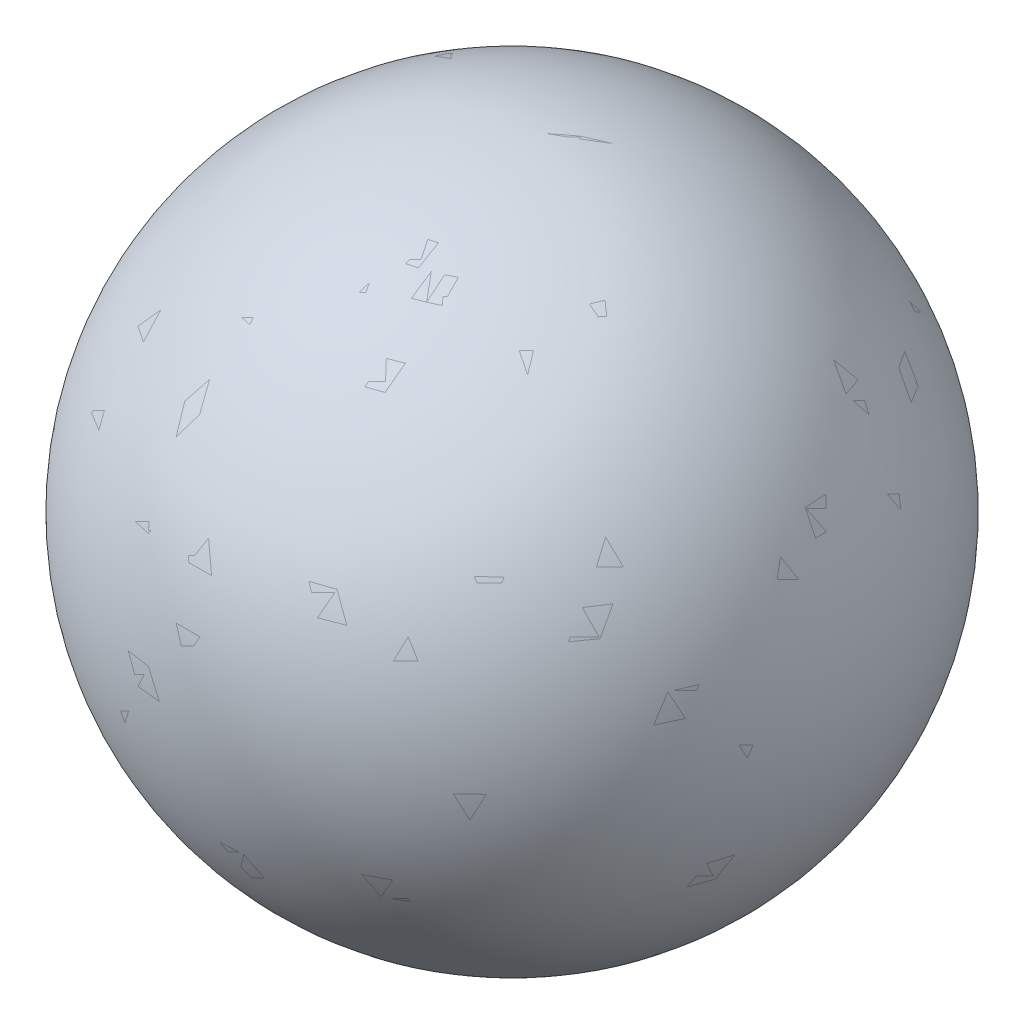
ISO-10303-21;
HEADER;
FILE_DESCRIPTION(('STEP AP214'),'2;1');
FILE_NAME('part.step','',(''),(''),'','','');
FILE_SCHEMA(('AUTOMOTIVE_DESIGN { 1 0 10303 214 1 1 1 1 }'));
ENDSEC;
DATA;
#1=APPLICATION_CONTEXT('core data for automotive mechanical design processes');
#2=APPLICATION_PROTOCOL_DEFINITION('international standard','automotive_design',2000,#1);
#3=PRODUCT_CONTEXT('',#1,'mechanical');
#4=PRODUCT('Part','Part','',(#3));
#5=PRODUCT_RELATED_PRODUCT_CATEGORY('part','',(#4));
#6=PRODUCT_DEFINITION_FORMATION('','',#4);
#7=PRODUCT_DEFINITION_CONTEXT('part definition',#1,'design');
#8=PRODUCT_DEFINITION('design','',#6,#7);
#9=PRODUCT_DEFINITION_SHAPE('','',#8);
#10=(LENGTH_UNIT() NAMED_UNIT(*) SI_UNIT(.MILLI.,.METRE.));
#11=(NAMED_UNIT(*) PLANE_ANGLE_UNIT() SI_UNIT($,.RADIAN.));
#12=(NAMED_UNIT(*) SI_UNIT($,.STERADIAN.) SOLID_ANGLE_UNIT());
#13=UNCERTAINTY_MEASURE_WITH_UNIT(LENGTH_MEASURE(1.E-05),#10,'distance_accuracy_value','');
#14=(GEOMETRIC_REPRESENTATION_CONTEXT(3) GLOBAL_UNCERTAINTY_ASSIGNED_CONTEXT((#13)) GLOBAL_UNIT_ASSIGNED_CONTEXT((#10,
#11,#12)) REPRESENTATION_CONTEXT('',''));
#15=CARTESIAN_POINT('',(0.,0.,0.));
#16=DIRECTION('',(0.,0.,1.));
#17=DIRECTION('',(1.,0.,0.));
#18=AXIS2_PLACEMENT_3D('',#15,#16,#17);
#19=CARTESIAN_POINT('',(0.,0.,0.));
#20=DIRECTION('',(0.,1.,0.));
#21=DIRECTION('',(1.,0.,0.));
#22=AXIS2_PLACEMENT_3D('',#19,#20,#21);
#23=SPHERICAL_SURFACE('',#22,35.);
#24=CARTESIAN_POINT('',(0.,35.,0.));
#25=VERTEX_POINT('',#24);
#26=VERTEX_LOOP('',#25);
#27=FACE_BOUND('',#26,.T.);
#28=ADVANCED_FACE('F42',(#27),#23,.T.);
#29=OPEN_SHELL('',(#28));
#30=SHELL_BASED_SURFACE_MODEL('B2',(#29));
#31=CARTESIAN_POINT('',(0.,0.,0.));
#32=DIRECTION('',(0.,1.,0.));
#33=DIRECTION('',(1.,0.,0.));
#34=AXIS2_PLACEMENT_3D('',#31,#32,#33);
#35=SPHERICAL_SURFACE('',#34,35.);
#36=CARTESIAN_POINT('',(0.,35.,0.));
#37=VERTEX_POINT('',#36);
#38=VERTEX_LOOP('',#37);
#39=FACE_BOUND('',#38,.T.);
#40=ADVANCED_FACE('F57',(#39),#35,.T.);
#41=CLOSED_SHELL('',(#40));
#42=MANIFOLD_SOLID_BREP('B6',#41);
#43=ADVANCED_BREP_SHAPE_REPRESENTATION('',(#18,#42),#14);
#44=MANIFOLD_SURFACE_SHAPE_REPRESENTATION('',(#18,#30),#14);
#45=SHAPE_REPRESENTATION('',(#18),#14);
#46=SHAPE_DEFINITION_REPRESENTATION(#9,#45);
#47=SHAPE_REPRESENTATION_RELATIONSHIP('','',#45,#43);
#48=SHAPE_REPRESENTATION_RELATIONSHIP('','',#45,#44);
ENDSEC;
END-ISO-10303-21;
